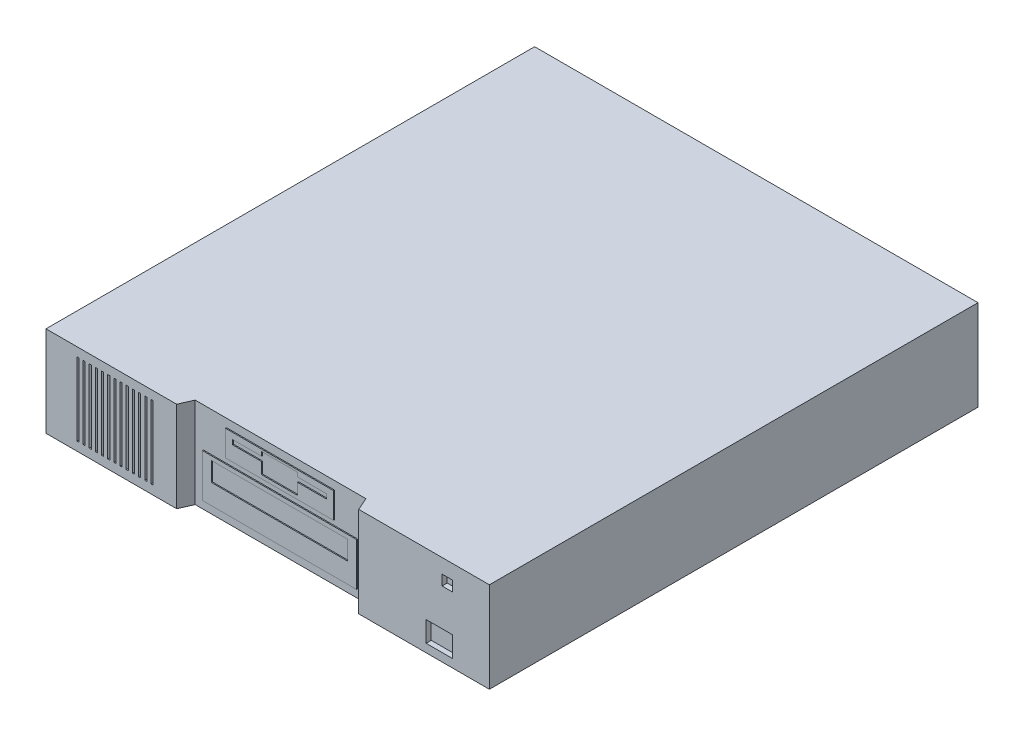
from build123d import *

# Parameters (mm, degrees)
BASE_EXTRUSION_DEPTH       = 44
ESQUISSE2_W                = 105
ESQUISSE2_H                = 25
ESQUISSE2_W_2              = 150
ESQUISSE2_H_2              = 42
BOSS_EXTRU_1_DEPTH         = 1
ESQUISSE3_W                = 132
ESQUISSE3_H                = 18.5
ENL_V_MAT_EXTRU_2_DEPTH    = 1
ESQUISSE4_W                = 2
ESQUISSE4_H                = 71
ENL_V_MAT_EXTRU_3_DEPTH    = 3
R_P_TITION_LIN_AIRE1_COUNT = 13
R_P_TITION_LIN_AIRE1_PITCH = 6
ESQUISSE5_W                = 10
ESQUISSE5_H                = 10
ESQUISSE5_W_2              = 25.5
ESQUISSE5_H_2              = 20
ENL_V_MAT_EXTRU_4_DEPTH    = 5


with BuildPart() as part:
    # Esquisse1 → Base-Extrusion (new, symmetric)
    with BuildSketch(Plane(origin=(0, 0, 0), x_dir=(1, 0, 0), z_dir=(0, 1, 0))):
        Polygon((-215.5, 237.5), (215.5, 237.5), (215.5, -237.5), (88.5, -237.5), (83, -225), (-83, -225), (-88.5, -237.5), (-215.5, -237.5), align=None)
    extrude(amount=BASE_EXTRUSION_DEPTH, both=True)

    # Esquisse2 → Boss.-Extru.1 (add)
    with BuildSketch(Plane.XY.offset(225)):
        with Locations((0, 23.5)):
            Rectangle(ESQUISSE2_W, ESQUISSE2_H)
        with Locations((0, -15)):
            Rectangle(ESQUISSE2_W_2, ESQUISSE2_H_2)
    extrude(amount=BOSS_EXTRU_1_DEPTH)

    # Esquisse3 → Enl_v. mat.-Extru.2 (cut)
    with BuildSketch(Plane.XY.offset(226)):
        with Locations((0, -7.25)):
            Rectangle(ESQUISSE3_W, ESQUISSE3_H)
        Polygon((-45.5, 30), (-17.5, 30), (-17.5, 34), (17.5, 34), (17.5, 30), (45.5, 30), (45.5, 25.5), (17.5, 25.5), (17.5, 14.5), (-17.5, 14.5), (-17.5, 25.5), (-45.5, 25.5), align=None)
    extrude(amount=-ENL_V_MAT_EXTRU_2_DEPTH, mode=Mode.SUBTRACT)

    # Esquisse4 → Enl_v. mat.-Extru.3 (cut)
    with BuildSketch(Plane.XY.offset(237.5)):
        with Locations((-112.5, 0)):
            Rectangle(ESQUISSE4_W, ESQUISSE4_H)
    enl_v_mat_extru_3 = extrude(amount=-ENL_V_MAT_EXTRU_3_DEPTH, mode=Mode.SUBTRACT)

    # R_p_tition lin_aire1: Enl_v. mat.-Extru.3 ×13
    with Locations(*[(-i * R_P_TITION_LIN_AIRE1_PITCH, 0, 0) for i in range(1, R_P_TITION_LIN_AIRE1_COUNT)]):
        add(enl_v_mat_extru_3, mode=Mode.SUBTRACT)

    # Esquisse5 → Enl_v. mat.-Extru.4 (cut)
    with BuildSketch(Plane.XY.offset(237.5)):
        with Locations((174.5, 25)):
            Rectangle(ESQUISSE5_W, ESQUISSE5_H)
        with Locations((166.75, -26)):
            Rectangle(ESQUISSE5_W_2, ESQUISSE5_H_2)
    extrude(amount=-ENL_V_MAT_EXTRU_4_DEPTH, mode=Mode.SUBTRACT)


solid = part.part
